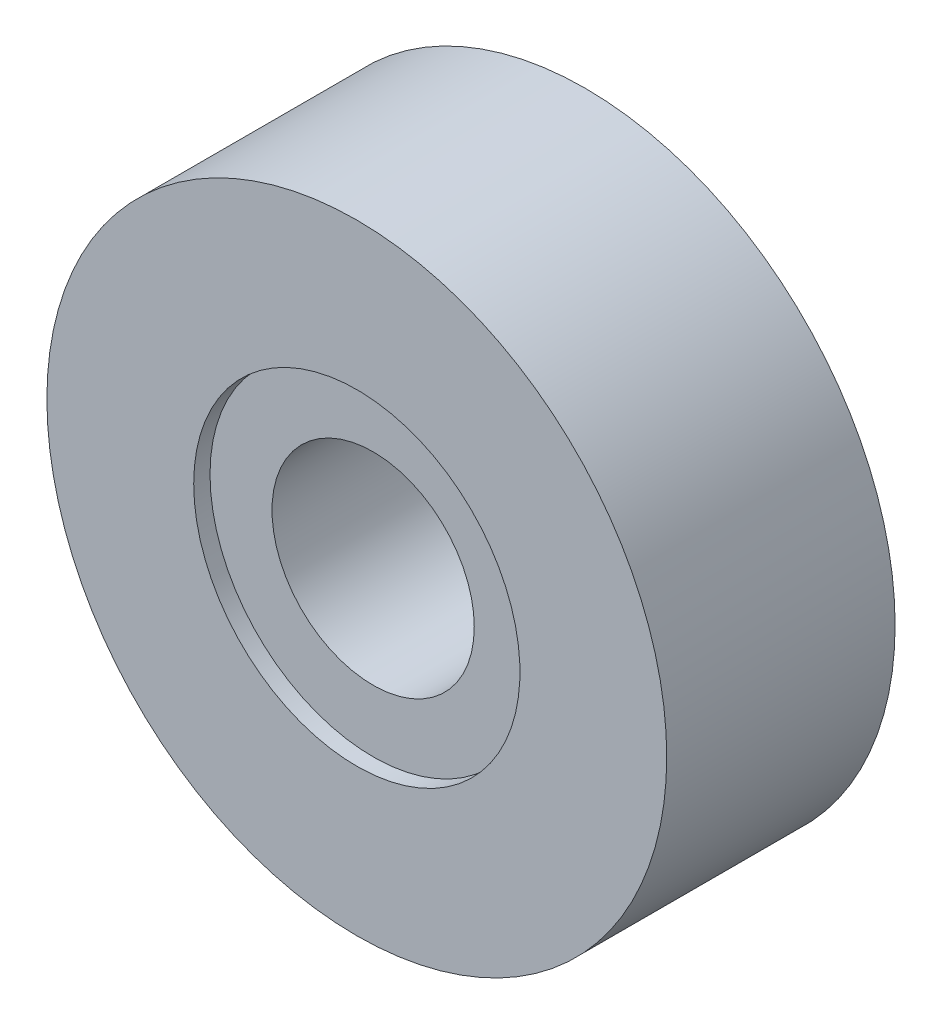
ISO-10303-21;
HEADER;
FILE_DESCRIPTION(('STEP AP214'),'2;1');
FILE_NAME('part.step','',(''),(''),'','','');
FILE_SCHEMA(('AUTOMOTIVE_DESIGN { 1 0 10303 214 1 1 1 1 }'));
ENDSEC;
DATA;
#1=APPLICATION_CONTEXT('core data for automotive mechanical design processes');
#2=APPLICATION_PROTOCOL_DEFINITION('international standard','automotive_design',2000,#1);
#3=PRODUCT_CONTEXT('',#1,'mechanical');
#4=PRODUCT('Part','Part','',(#3));
#5=PRODUCT_RELATED_PRODUCT_CATEGORY('part','',(#4));
#6=PRODUCT_DEFINITION_FORMATION('','',#4);
#7=PRODUCT_DEFINITION_CONTEXT('part definition',#1,'design');
#8=PRODUCT_DEFINITION('design','',#6,#7);
#9=PRODUCT_DEFINITION_SHAPE('','',#8);
#10=(LENGTH_UNIT() NAMED_UNIT(*) SI_UNIT(.MILLI.,.METRE.));
#11=(NAMED_UNIT(*) PLANE_ANGLE_UNIT() SI_UNIT($,.RADIAN.));
#12=(NAMED_UNIT(*) SI_UNIT($,.STERADIAN.) SOLID_ANGLE_UNIT());
#13=UNCERTAINTY_MEASURE_WITH_UNIT(LENGTH_MEASURE(1.E-05),#10,'distance_accuracy_value','');
#14=(GEOMETRIC_REPRESENTATION_CONTEXT(3) GLOBAL_UNCERTAINTY_ASSIGNED_CONTEXT((#13)) GLOBAL_UNIT_ASSIGNED_CONTEXT((#10,
#11,#12)) REPRESENTATION_CONTEXT('',''));
#15=CARTESIAN_POINT('',(0.,0.,0.));
#16=DIRECTION('',(0.,0.,1.));
#17=DIRECTION('',(1.,0.,0.));
#18=AXIS2_PLACEMENT_3D('',#15,#16,#17);
#19=CARTESIAN_POINT('',(0.,0.,0.));
#20=DIRECTION('',(0.,0.,1.));
#21=DIRECTION('',(1.,0.,0.));
#22=AXIS2_PLACEMENT_3D('',#19,#20,#21);
#23=CYLINDRICAL_SURFACE('',#22,3.1);
#24=CARTESIAN_POINT('',(0.,0.,3.));
#25=DIRECTION('',(0.,0.,1.));
#26=DIRECTION('',(1.,0.,0.));
#27=AXIS2_PLACEMENT_3D('',#24,#25,#26);
#28=CIRCLE('',#27,3.1);
#29=CARTESIAN_POINT('',(3.1,0.,3.));
#30=VERTEX_POINT('',#29);
#31=EDGE_CURVE('E40',#30,#30,#28,.T.);
#32=ORIENTED_EDGE('',*,*,#31,.T.);
#33=EDGE_LOOP('',(#32));
#34=FACE_BOUND('',#33,.T.);
#35=CARTESIAN_POINT('',(0.,0.,-3.));
#36=DIRECTION('',(0.,0.,1.));
#37=DIRECTION('',(1.,0.,0.));
#38=AXIS2_PLACEMENT_3D('',#35,#36,#37);
#39=CIRCLE('',#38,3.1);
#40=CARTESIAN_POINT('',(3.1,0.,-3.));
#41=VERTEX_POINT('',#40);
#42=EDGE_CURVE('E18',#41,#41,#39,.F.);
#43=ORIENTED_EDGE('',*,*,#42,.T.);
#44=EDGE_LOOP('',(#43));
#45=FACE_BOUND('',#44,.T.);
#46=ADVANCED_FACE('F14',(#34,#45),#23,.F.);
#47=CARTESIAN_POINT('',(5.1,5.1,-3.));
#48=DIRECTION('',(0.,0.,1.));
#49=DIRECTION('',(-1.,0.,0.));
#50=AXIS2_PLACEMENT_3D('',#47,#48,#49);
#51=PLANE('',#50);
#52=ORIENTED_EDGE('',*,*,#42,.F.);
#53=EDGE_LOOP('',(#52));
#54=FACE_BOUND('',#53,.T.);
#55=CARTESIAN_POINT('',(0.,0.,-3.));
#56=DIRECTION('',(0.,0.,1.));
#57=DIRECTION('',(0.,-1.,0.));
#58=AXIS2_PLACEMENT_3D('',#55,#56,#57);
#59=CIRCLE('',#58,5.);
#60=CARTESIAN_POINT('',(0.,-5.,-3.));
#61=VERTEX_POINT('',#60);
#62=EDGE_CURVE('E38',#61,#61,#59,.F.);
#63=ORIENTED_EDGE('',*,*,#62,.T.);
#64=EDGE_LOOP('',(#63));
#65=FACE_BOUND('',#64,.T.);
#66=ADVANCED_FACE('F48',(#54,#65),#51,.F.);
#67=CARTESIAN_POINT('',(0.,0.,3.));
#68=DIRECTION('',(0.,0.,-1.));
#69=DIRECTION('',(-1.,0.,0.));
#70=AXIS2_PLACEMENT_3D('',#67,#68,#69);
#71=PLANE('',#70);
#72=ORIENTED_EDGE('',*,*,#31,.F.);
#73=EDGE_LOOP('',(#72));
#74=FACE_BOUND('',#73,.T.);
#75=CARTESIAN_POINT('',(0.,0.,3.));
#76=DIRECTION('',(0.,0.,-1.));
#77=DIRECTION('',(-1.,0.,0.));
#78=AXIS2_PLACEMENT_3D('',#75,#76,#77);
#79=CIRCLE('',#78,5.);
#80=CARTESIAN_POINT('',(-5.,0.,3.));
#81=VERTEX_POINT('',#80);
#82=EDGE_CURVE('E35',#81,#81,#79,.F.);
#83=ORIENTED_EDGE('',*,*,#82,.T.);
#84=EDGE_LOOP('',(#83));
#85=FACE_BOUND('',#84,.T.);
#86=ADVANCED_FACE('F51',(#74,#85),#71,.F.);
#87=CARTESIAN_POINT('',(0.,0.,-3.5));
#88=DIRECTION('',(0.,0.,1.));
#89=DIRECTION('',(0.,-1.,0.));
#90=AXIS2_PLACEMENT_3D('',#87,#88,#89);
#91=CYLINDRICAL_SURFACE('',#90,5.);
#92=CARTESIAN_POINT('',(0.,0.,-3.5));
#93=DIRECTION('',(0.,0.,1.));
#94=DIRECTION('',(0.,-1.,0.));
#95=AXIS2_PLACEMENT_3D('',#92,#93,#94);
#96=CIRCLE('',#95,5.);
#97=CARTESIAN_POINT('',(0.,-5.,-3.5));
#98=VERTEX_POINT('',#97);
#99=EDGE_CURVE('E32',#98,#98,#96,.T.);
#100=ORIENTED_EDGE('',*,*,#99,.F.);
#101=EDGE_LOOP('',(#100));
#102=FACE_BOUND('',#101,.T.);
#103=ORIENTED_EDGE('',*,*,#62,.F.);
#104=EDGE_LOOP('',(#103));
#105=FACE_BOUND('',#104,.T.);
#106=ADVANCED_FACE('F16',(#102,#105),#91,.F.);
#107=CARTESIAN_POINT('',(0.,0.,3.5));
#108=DIRECTION('',(0.,0.,-1.));
#109=DIRECTION('',(-1.,0.,0.));
#110=AXIS2_PLACEMENT_3D('',#107,#108,#109);
#111=CYLINDRICAL_SURFACE('',#110,5.);
#112=CARTESIAN_POINT('',(0.,0.,3.5));
#113=DIRECTION('',(0.,0.,-1.));
#114=DIRECTION('',(-1.,0.,0.));
#115=AXIS2_PLACEMENT_3D('',#112,#113,#114);
#116=CIRCLE('',#115,5.);
#117=CARTESIAN_POINT('',(-5.,0.,3.5));
#118=VERTEX_POINT('',#117);
#119=EDGE_CURVE('E27',#118,#118,#116,.F.);
#120=ORIENTED_EDGE('',*,*,#119,.T.);
#121=EDGE_LOOP('',(#120));
#122=FACE_BOUND('',#121,.T.);
#123=ORIENTED_EDGE('',*,*,#82,.F.);
#124=EDGE_LOOP('',(#123));
#125=FACE_BOUND('',#124,.T.);
#126=ADVANCED_FACE('F55',(#122,#125),#111,.F.);
#127=CARTESIAN_POINT('',(0.,0.,-3.5));
#128=DIRECTION('',(0.,0.,-1.));
#129=DIRECTION('',(-1.,0.,0.));
#130=AXIS2_PLACEMENT_3D('',#127,#128,#129);
#131=PLANE('',#130);
#132=ORIENTED_EDGE('',*,*,#99,.T.);
#133=EDGE_LOOP('',(#132));
#134=FACE_BOUND('',#133,.T.);
#135=CARTESIAN_POINT('',(0.,0.,-3.5));
#136=DIRECTION('',(0.,0.,1.));
#137=DIRECTION('',(1.,0.,0.));
#138=AXIS2_PLACEMENT_3D('',#135,#136,#137);
#139=CIRCLE('',#138,9.5);
#140=CARTESIAN_POINT('',(9.5,0.,-3.5));
#141=VERTEX_POINT('',#140);
#142=EDGE_CURVE('E22',#141,#141,#139,.T.);
#143=ORIENTED_EDGE('',*,*,#142,.F.);
#144=EDGE_LOOP('',(#143));
#145=FACE_BOUND('',#144,.T.);
#146=ADVANCED_FACE('F62',(#134,#145),#131,.T.);
#147=CARTESIAN_POINT('',(0.,0.,3.5));
#148=DIRECTION('',(0.,0.,-1.));
#149=DIRECTION('',(-1.,0.,0.));
#150=AXIS2_PLACEMENT_3D('',#147,#148,#149);
#151=PLANE('',#150);
#152=ORIENTED_EDGE('',*,*,#119,.F.);
#153=EDGE_LOOP('',(#152));
#154=FACE_BOUND('',#153,.T.);
#155=CARTESIAN_POINT('',(0.,0.,3.5));
#156=DIRECTION('',(0.,0.,1.));
#157=DIRECTION('',(1.,0.,0.));
#158=AXIS2_PLACEMENT_3D('',#155,#156,#157);
#159=CIRCLE('',#158,9.5);
#160=CARTESIAN_POINT('',(9.5,0.,3.5));
#161=VERTEX_POINT('',#160);
#162=EDGE_CURVE('E10',#161,#161,#159,.F.);
#163=ORIENTED_EDGE('',*,*,#162,.F.);
#164=EDGE_LOOP('',(#163));
#165=FACE_BOUND('',#164,.T.);
#166=ADVANCED_FACE('F70',(#154,#165),#151,.F.);
#167=CARTESIAN_POINT('',(0.,0.,0.));
#168=DIRECTION('',(0.,0.,1.));
#169=DIRECTION('',(1.,0.,0.));
#170=AXIS2_PLACEMENT_3D('',#167,#168,#169);
#171=CYLINDRICAL_SURFACE('',#170,9.5);
#172=ORIENTED_EDGE('',*,*,#162,.T.);
#173=EDGE_LOOP('',(#172));
#174=FACE_BOUND('',#173,.T.);
#175=ORIENTED_EDGE('',*,*,#142,.T.);
#176=EDGE_LOOP('',(#175));
#177=FACE_BOUND('',#176,.T.);
#178=ADVANCED_FACE('F68',(#174,#177),#171,.T.);
#179=CLOSED_SHELL('',(#46,#66,#86,#106,#126,#146,#166,#178));
#180=MANIFOLD_SOLID_BREP('B1',#179);
#181=ADVANCED_BREP_SHAPE_REPRESENTATION('',(#18,#180),#14);
#182=SHAPE_DEFINITION_REPRESENTATION(#9,#181);
ENDSEC;
END-ISO-10303-21;
